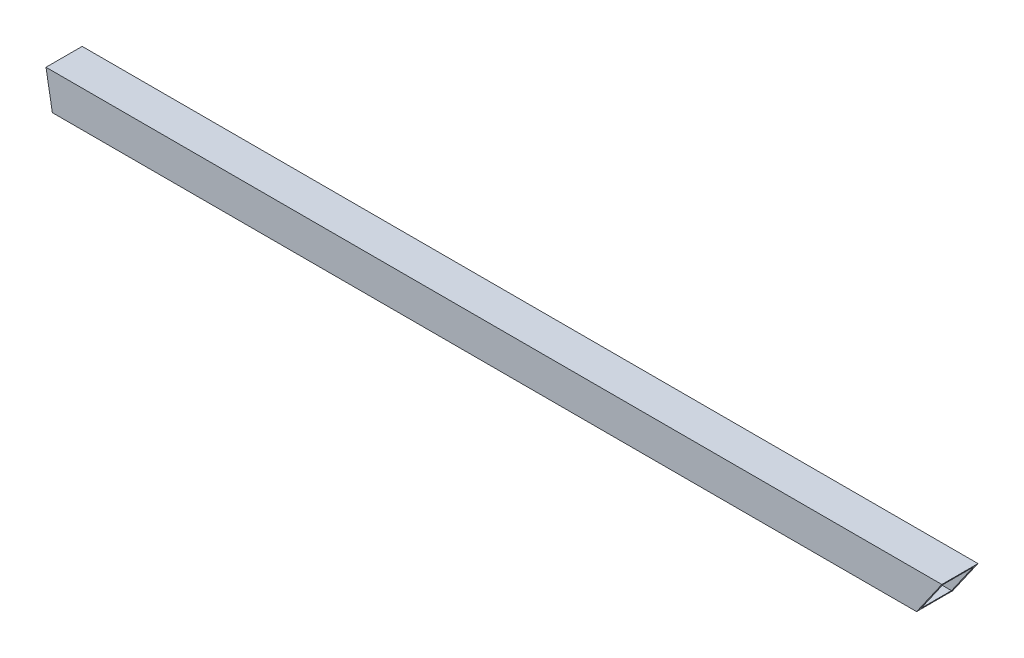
from build123d import *

# Parameters (mm, degrees)
BOSS_EXTRU_1_DEPTH      = 25
ESQUISSE2_W             = 21
ESQUISSE2_H             = 26.487678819
ENL_V_MAT_EXTRU_1_DEPTH = 621.356264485


with BuildPart() as part:
    # Esquisse1 → Boss.-Extru.1 (new body)
    with BuildSketch(Plane.XY):
        Polygon((20.783025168, 0), (640, 0), (622.550112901, -25), (25.174193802, -25), align=None)
    extrude(amount=BOSS_EXTRU_1_DEPTH)

    # Esquisse2 → Enl_v. mat.-Extru.1 (cut, through all, along a direction that is not the sketch's normal)
    with BuildSketch(Plane(origin=(430.339558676, -300.375068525, 0), x_dir=(0, 0, -1), z_dir=(0.8200033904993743, -0.5723586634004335, 0))):
        with Locations((-12.5, 351.065705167)):
            Rectangle(ESQUISSE2_W, ESQUISSE2_H)
    extrude(amount=-ENL_V_MAT_EXTRU_1_DEPTH, dir=(1, 0, 0), mode=Mode.SUBTRACT)


solid = part.part
